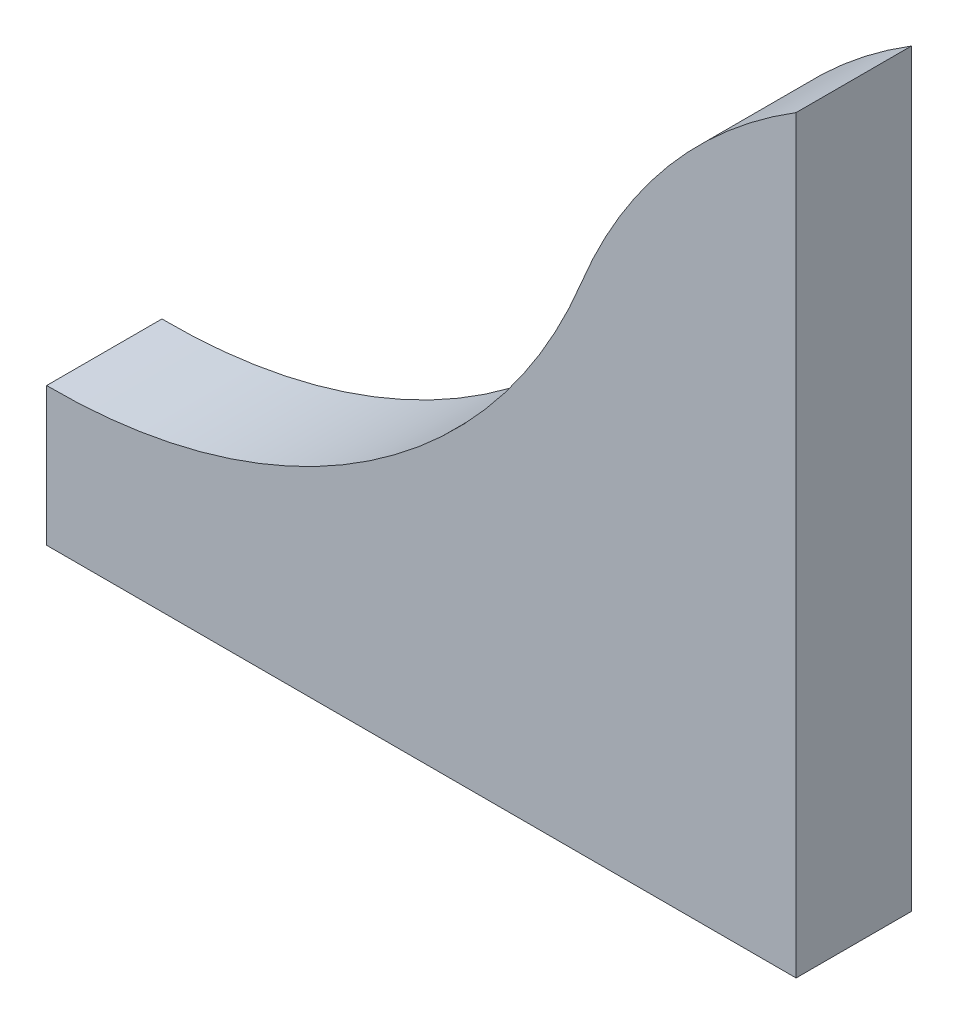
from build123d import *

# Parameters (mm, degrees)
EXTRUDE1_DEPTH = 10


with BuildPart() as part:
    # Sketch1 → Extrude1 (new body)
    with BuildSketch(Plane.XY):
        with BuildLine():
            Line((-65, 0), (0, 0))
            Line((0, 0), (0, 65))
            ThreePointArc((0, 65), (-11.060773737, 55.462379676), (-18.602150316, 42.954999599))
            ThreePointArc((-18.602150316, 42.954999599), (-37.028839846, 20.324559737), (-65, 12.00026427))
            Line((-65, 12.00026427), (-65, 0))
        make_face()
    extrude(amount=EXTRUDE1_DEPTH)


solid = part.part
